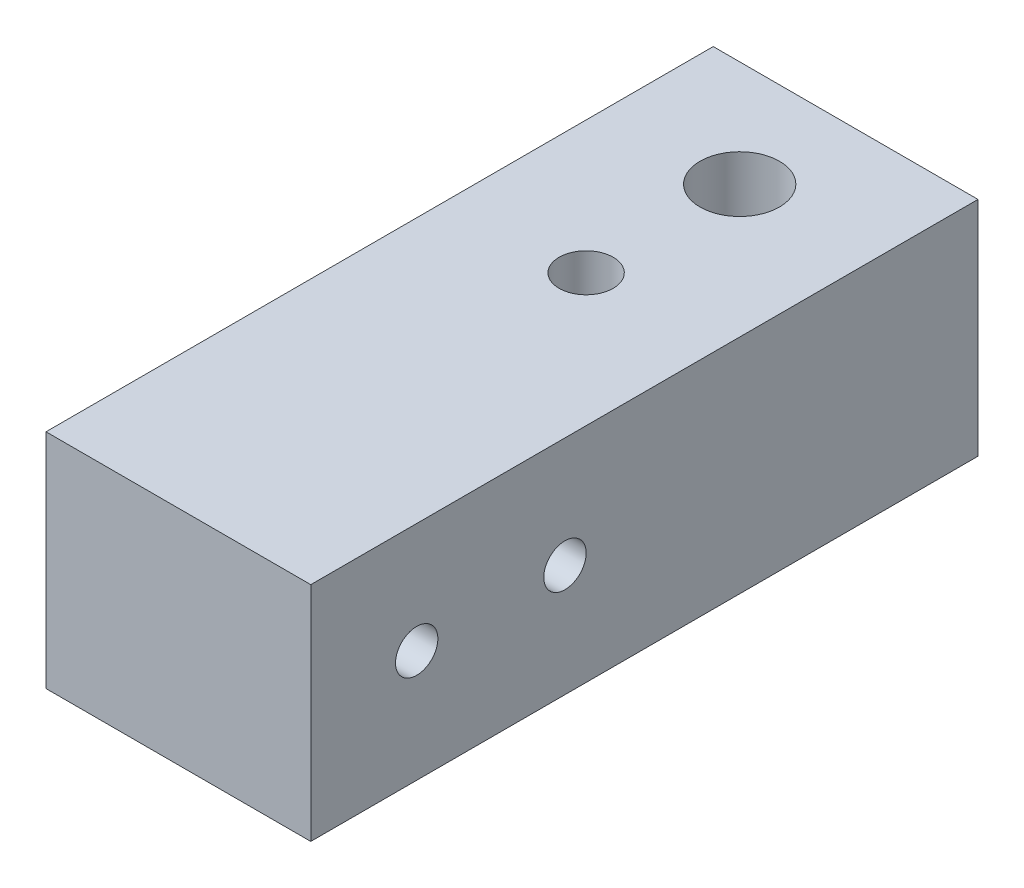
from build123d import *

# Parameters (mm, degrees)
SKETCH1_R               = 5.1
BOSS_EXTRUDE3_DEPTH     = 42
SKETCH1_W               = 50
SKETCH1_H               = 126
SKETCH1_R_2             = 4
SKETCH1_R_3             = 11
BOSS_EXTRUDE3_2_DEPTH   = 42
CUT_EXTRUDE2_START      = -10
SKETCH2_R               = 4
CUT_EXTRUDE2_DEPTH      = 96.124056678
SKETCH3_R               = 11
BOSS_EXTRUDE5_DEPTH     = 42
SKETCH3_2_R             = 11
CUT_EXTRUDE3_DEPTH      = 10
CUT_EXTRUDE5_DEPTH      = 586.342220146
CUT_EXTRUDE5_DEPTH_BACK = 586.342220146
SKETCH1_5_R             = 5.1
CUT_EXTRUDE9_START      = -10
SKETCH6_R               = 1.75
CUT_EXTRUDE9_DEPTH      = 5
CUT_EXTRUDE10_START     = -42
SKETCH7_R               = 7.5
CUT_EXTRUDE10_DEPTH     = 28


with BuildPart() as part:
    # Sketch1 → Boss-Extrude3 (new body)
    with BuildSketch(Plane(origin=(0, 0, 0), x_dir=(1, 0, 0), z_dir=(0, 1, 0))):
        with Locations(Location((552.99173644, 33.383659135, 0), (0, 0, 90))):
            Circle(SKETCH1_R)
    extrude(amount=BOSS_EXTRUDE3_DEPTH)


with BuildPart() as body_2:
    # Sketch1 → Boss-Extrude3 2 (new body)
    with BuildSketch(Plane(origin=(0, 0, 0), x_dir=(1, 0, 0), z_dir=(0, 1, 0))):
        with Locations((552.99173644, 19.383659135)):
            Rectangle(SKETCH1_W, SKETCH1_H)
        with Locations(Location((552.99173644, 62.383659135, 0), (0, 0, 90))):
            Circle(SKETCH1_R_2, mode=Mode.SUBTRACT)
        with Locations(Location((552.99173644, 33.383659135, 0), (0, 0, 90))):
            Circle(SKETCH1_R_3, mode=Mode.SUBTRACT)
    extrude(amount=BOSS_EXTRUDE3_2_DEPTH)

    # Sketch2 → Cut-Extrude2 (cut, through all)
    with BuildSketch(Plane.ZY.offset(-527.99173644).offset(CUT_EXTRUDE2_START)):
        with Locations((23.616340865, 21.172874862)):
            Circle(SKETCH2_R)
        with Locations((-4.383659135, 21.172874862)):
            Circle(SKETCH2_R)
    extrude(amount=-CUT_EXTRUDE2_DEPTH, mode=Mode.SUBTRACT)

    # Sketch3 → Boss-Extrude5 (add, through all)
    with BuildSketch(Plane.XZ):
        with Locations((552.99173644, -33.383659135)):
            Circle(SKETCH3_R)
    extrude(amount=-BOSS_EXTRUDE5_DEPTH)

    # Sketch3_2 → Cut-Extrude3 (cut)
    with BuildSketch(Plane.XZ):
        with Locations(Location((552.99173644, -33.383659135, 0), (0, 0, 270))):
            Circle(SKETCH3_2_R)
    extrude(amount=-CUT_EXTRUDE3_DEPTH, mode=Mode.SUBTRACT)


with BuildPart() as cut_extrude5_tool:
    # Sketch1_5 → Cut-Extrude5 (new, two sides: drawn at the far end of the back side and taken through both)
    with BuildSketch(Plane(origin=(0, 0, 0), x_dir=(1, 0, 0), z_dir=(0, 1, 0)).offset(-CUT_EXTRUDE5_DEPTH_BACK)):
        with Locations(Location((552.99173644, 33.383659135, 0), (0, 0, 90))):
            Circle(SKETCH1_5_R)
    extrude(amount=CUT_EXTRUDE5_DEPTH + CUT_EXTRUDE5_DEPTH_BACK)


with BuildPart() as part_1:
    add(part.part)

    # Cut-Extrude5: cut by cut_extrude5_tool
    add(cut_extrude5_tool.part, mode=Mode.SUBTRACT)


with BuildPart() as body_2_1:
    add(body_2.part)

    # Cut-Extrude5: cut by cut_extrude5_tool
    add(cut_extrude5_tool.part, mode=Mode.SUBTRACT)

    # Sketch6 → Cut-Extrude9 (cut)
    with BuildSketch(Plane.XZ.offset(CUT_EXTRUDE9_START)):
        with Locations(Location((552.99173644, -25.383659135, 0), (0, 0, 270))):
            Circle(SKETCH6_R)
        with Locations(Location((560.99173644, -33.383659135, 0), (0, 0, 270))):
            Circle(SKETCH6_R)
        with Locations(Location((552.99173644, -41.383659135, 0), (0, 0, 270))):
            Circle(SKETCH6_R)
        with Locations(Location((544.99173644, -33.383659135, 0), (0, 0, 270))):
            Circle(SKETCH6_R)
    extrude(amount=-CUT_EXTRUDE9_DEPTH, mode=Mode.SUBTRACT)

    # Sketch7 → Cut-Extrude10 (cut)
    with BuildSketch(Plane.XZ.offset(CUT_EXTRUDE10_START)):
        with Locations(Location((552.99173644, -62.383659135, 0), (0, 0, 90))):
            Circle(SKETCH7_R)
    extrude(amount=CUT_EXTRUDE10_DEPTH, mode=Mode.SUBTRACT)


solid = body_2_1.part
